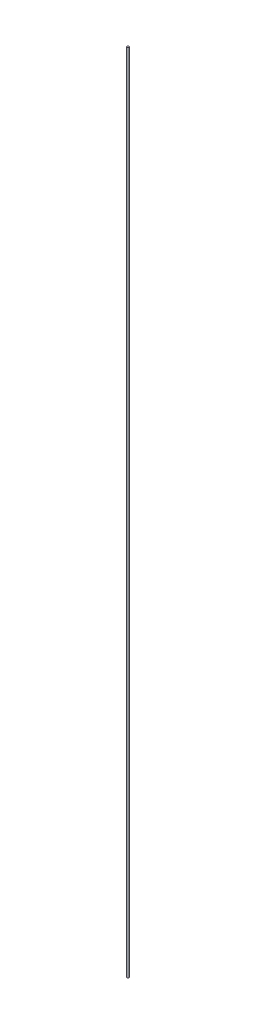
ISO-10303-21;
HEADER;
FILE_DESCRIPTION(('STEP AP214'),'2;1');
FILE_NAME('part.step','',(''),(''),'','','');
FILE_SCHEMA(('AUTOMOTIVE_DESIGN { 1 0 10303 214 1 1 1 1 }'));
ENDSEC;
DATA;
#1=APPLICATION_CONTEXT('core data for automotive mechanical design processes');
#2=APPLICATION_PROTOCOL_DEFINITION('international standard','automotive_design',2000,#1);
#3=PRODUCT_CONTEXT('',#1,'mechanical');
#4=PRODUCT('Part','Part','',(#3));
#5=PRODUCT_RELATED_PRODUCT_CATEGORY('part','',(#4));
#6=PRODUCT_DEFINITION_FORMATION('','',#4);
#7=PRODUCT_DEFINITION_CONTEXT('part definition',#1,'design');
#8=PRODUCT_DEFINITION('design','',#6,#7);
#9=PRODUCT_DEFINITION_SHAPE('','',#8);
#10=(LENGTH_UNIT() NAMED_UNIT(*) SI_UNIT(.MILLI.,.METRE.));
#11=(NAMED_UNIT(*) PLANE_ANGLE_UNIT() SI_UNIT($,.RADIAN.));
#12=(NAMED_UNIT(*) SI_UNIT($,.STERADIAN.) SOLID_ANGLE_UNIT());
#13=UNCERTAINTY_MEASURE_WITH_UNIT(LENGTH_MEASURE(1.E-05),#10,'distance_accuracy_value','');
#14=(GEOMETRIC_REPRESENTATION_CONTEXT(3) GLOBAL_UNCERTAINTY_ASSIGNED_CONTEXT((#13)) GLOBAL_UNIT_ASSIGNED_CONTEXT((#10,
#11,#12)) REPRESENTATION_CONTEXT('',''));
#15=CARTESIAN_POINT('',(0.,0.,0.));
#16=DIRECTION('',(0.,0.,1.));
#17=DIRECTION('',(1.,0.,0.));
#18=AXIS2_PLACEMENT_3D('',#15,#16,#17);
#19=CARTESIAN_POINT('',(0.,1180.,0.));
#20=DIRECTION('',(0.,-1.,0.));
#21=DIRECTION('',(0.,0.,-1.));
#22=AXIS2_PLACEMENT_3D('',#19,#20,#21);
#23=CYLINDRICAL_SURFACE('',#22,1.5);
#24=CARTESIAN_POINT('',(0.,1180.,0.));
#25=DIRECTION('',(0.,1.,0.));
#26=DIRECTION('',(0.,0.,1.));
#27=AXIS2_PLACEMENT_3D('',#24,#25,#26);
#28=CIRCLE('',#27,1.5);
#29=CARTESIAN_POINT('',(0.,1180.,1.5));
#30=VERTEX_POINT('',#29);
#31=EDGE_CURVE('E10',#30,#30,#28,.T.);
#32=ORIENTED_EDGE('',*,*,#31,.F.);
#33=EDGE_LOOP('',(#32));
#34=FACE_BOUND('',#33,.T.);
#35=CARTESIAN_POINT('',(0.,0.,0.));
#36=DIRECTION('',(0.,1.,0.));
#37=DIRECTION('',(0.,0.,1.));
#38=AXIS2_PLACEMENT_3D('',#35,#36,#37);
#39=CIRCLE('',#38,1.5);
#40=CARTESIAN_POINT('',(0.,0.,1.5));
#41=VERTEX_POINT('',#40);
#42=EDGE_CURVE('E33',#41,#41,#39,.T.);
#43=ORIENTED_EDGE('',*,*,#42,.T.);
#44=EDGE_LOOP('',(#43));
#45=FACE_BOUND('',#44,.T.);
#46=ADVANCED_FACE('F30',(#34,#45),#23,.T.);
#47=CARTESIAN_POINT('',(0.,1180.,0.));
#48=DIRECTION('',(0.,1.,0.));
#49=DIRECTION('',(0.,0.,1.));
#50=AXIS2_PLACEMENT_3D('',#47,#48,#49);
#51=PLANE('',#50);
#52=ORIENTED_EDGE('',*,*,#31,.T.);
#53=EDGE_LOOP('',(#52));
#54=FACE_BOUND('',#53,.T.);
#55=ADVANCED_FACE('F45',(#54),#51,.T.);
#56=CARTESIAN_POINT('',(0.,0.,0.));
#57=DIRECTION('',(0.,1.,0.));
#58=DIRECTION('',(0.,0.,1.));
#59=AXIS2_PLACEMENT_3D('',#56,#57,#58);
#60=PLANE('',#59);
#61=ORIENTED_EDGE('',*,*,#42,.F.);
#62=EDGE_LOOP('',(#61));
#63=FACE_BOUND('',#62,.T.);
#64=ADVANCED_FACE('F43',(#63),#60,.F.);
#65=CLOSED_SHELL('',(#46,#55,#64));
#66=MANIFOLD_SOLID_BREP('B2',#65);
#67=ADVANCED_BREP_SHAPE_REPRESENTATION('',(#18,#66),#14);
#68=SHAPE_DEFINITION_REPRESENTATION(#9,#67);
ENDSEC;
END-ISO-10303-21;
